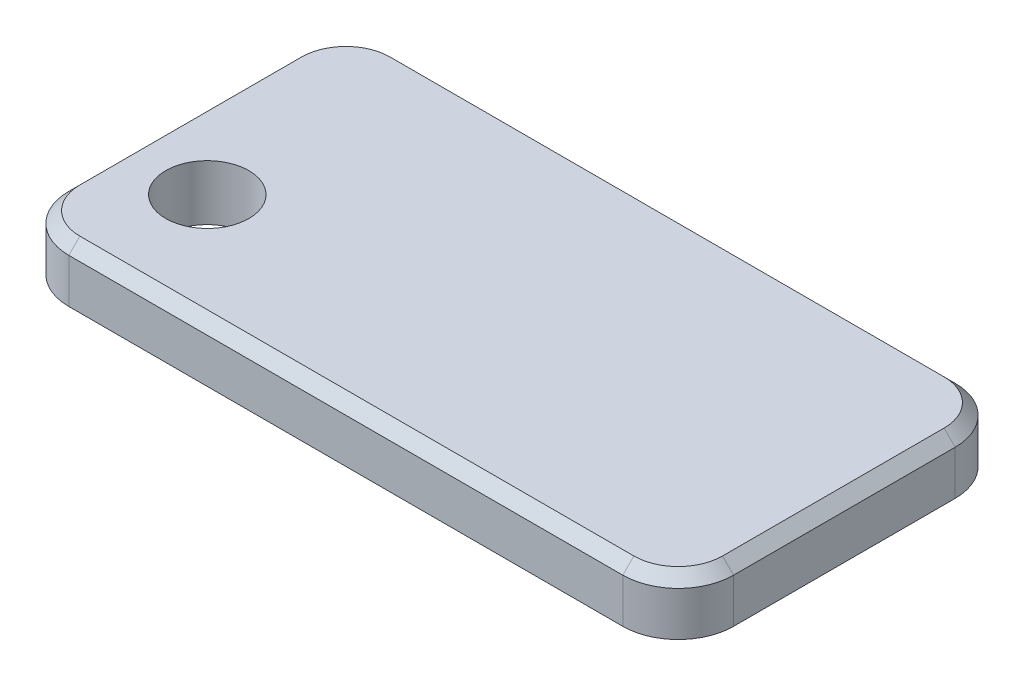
from build123d import *

# Parameters (mm, degrees)
SKETCH1_W          = 152.4
SKETCH1_H          = 76.2
EXTRUDE1_DEPTH     = 12.7
SKETCH2_R          = 9.525
CUT_EXTRUDE1_DEPTH = 171.861025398
FILLET1_R          = 12.7
CHAMFER1_SIZE      = 2.54


with BuildPart() as part:
    # Sketch1 → Extrude1 (new body)
    with BuildSketch(Plane(origin=(0, 0, 0), x_dir=(1, 0, 0), z_dir=(0, 1, 0))):
        with Locations((76.2, 38.1)):
            Rectangle(SKETCH1_W, SKETCH1_H)
    extrude(amount=EXTRUDE1_DEPTH)

    # Sketch2 → Cut-Extrude1 (cut, through all)
    with BuildSketch(Plane(origin=(0, 12.7, 0), x_dir=(-1, 0, 0), z_dir=(0, 1, 0))):
        with Locations(Location((-19.05, -25.4, 0), (0, 0, 90))):
            Circle(SKETCH2_R)
    extrude(amount=-CUT_EXTRUDE1_DEPTH, mode=Mode.SUBTRACT)

    # Fillet1
    fillet1_edges = [part.edges().sort_by_distance(p)[0] for p in [
        (0, 6.35, -76.2),
        (152.4, 6.35, -76.2),
        (152.4, 6.35, 0),
        (0, 6.35, 0),
    ]]
    fillet(fillet1_edges, radius=FILLET1_R)

    # Chamfer1
    chamfer1_edges = [part.edges().sort_by_distance(p)[0] for p in [
        (76.2, 12.7, -76.2),
        (152.4, 12.7, -38.1),
        (0, 12.7, -38.1),
        (76.2, 12.7, 0),
        (3.719743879, 12.7, -72.480256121),
        (3.719743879, 12.7, -3.719743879),
        (148.680256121, 12.7, -3.719743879),
        (148.680256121, 12.7, -72.480256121),
    ]]
    chamfer(chamfer1_edges, length=CHAMFER1_SIZE)


solid = part.part
